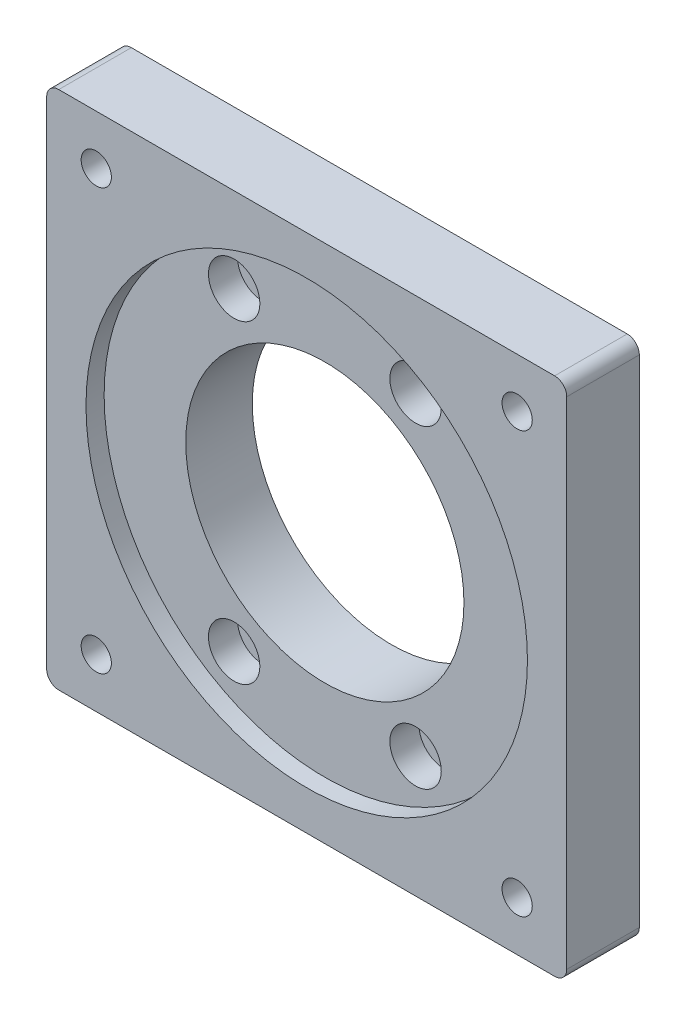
from build123d import *

# Parameters (mm, degrees)
SKETCH_1_W             = 86
SKETCH_1_H             = 86
SKETCH_1_R             = 23
EXTRUDE_1_DEPTH        = 12
SKETCH_2_R             = 2.1
CUT_EXTRUDE_1_DEPTH    = 62.983868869
SKETCH_3_R             = 36.5
CUT_EXTRUDE_2_DEPTH    = 3
SKETCH_5_R             = 2.25
CUT_EXTRUDE_3_DEPTH    = 62.473571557
SKETCH_6_R             = 4.25
CUT_EXTRUDE_4_DEPTH    = 4.8
FILLET_1_R             = 2
EXTRUDE_START          = 2
SKETCH_7_R             = 25
SKETCH_7_R_2           = 23
EXTRUDE_2_DEPTH        = 2
HOLE_WIZARD_M6_5_D     = 5
HOLE_WIZARD_M6_5_DEPTH = 15
HOLE_WIZARD_M6_5_TIP   = 1.502151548


with BuildPart() as part:
    # Sketch 1 → Extrude 1 (new body)
    with BuildSketch(Plane.XY):
        Rectangle(SKETCH_1_W, SKETCH_1_H)
        Circle(SKETCH_1_R, mode=Mode.SUBTRACT)
    extrude(amount=EXTRUDE_1_DEPTH)

    # Sketch 2 → Cut-Extrude 1 (cut, through all)
    with BuildSketch(Plane.XY.offset(12)):
        with Locations((-34.8, 34.8)):
            Circle(SKETCH_2_R)
        with Locations((34.8, 34.8)):
            Circle(SKETCH_2_R)
        with Locations((34.8, -34.8)):
            Circle(SKETCH_2_R)
        with Locations((-34.8, -34.8)):
            Circle(SKETCH_2_R)
    extrude(amount=-CUT_EXTRUDE_1_DEPTH, mode=Mode.SUBTRACT)

    # Sketch 3 → Cut-Extrude 2 (cut)
    with BuildSketch(Plane.XY.offset(12)):
        Circle(SKETCH_3_R)
    extrude(amount=-CUT_EXTRUDE_2_DEPTH, mode=Mode.SUBTRACT)

    # Sketch 5 → Cut-Extrude 3 (cut, through all)
    with BuildSketch(Plane.XY.offset(9)):
        with Locations((-15, 25.980762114)):
            Circle(SKETCH_5_R)
        with Locations((15, 25.980762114)):
            Circle(SKETCH_5_R)
        with Locations((15, -25.980762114)):
            Circle(SKETCH_5_R)
        with Locations((-15, -25.980762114)):
            Circle(SKETCH_5_R)
    extrude(amount=-CUT_EXTRUDE_3_DEPTH, mode=Mode.SUBTRACT)

    # Sketch 6 → Cut-Extrude 4 (cut)
    with BuildSketch(Plane.XY.offset(9)):
        with Locations((-15, 25.980762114)):
            Circle(SKETCH_6_R)
        with Locations((15, 25.980762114)):
            Circle(SKETCH_6_R)
        with Locations((15, -25.980762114)):
            Circle(SKETCH_6_R)
        with Locations((-15, -25.980762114)):
            Circle(SKETCH_6_R)
    extrude(amount=-CUT_EXTRUDE_4_DEPTH, mode=Mode.SUBTRACT)

    # Fillet 1
    fillet_1_edges = [part.edges().sort_by_distance(p)[0] for p in [
        (43, -43, 6),
        (-43, -43, 6),
        (-43, 43, 6),
        (43, 43, 6),
    ]]
    fillet(fillet_1_edges, radius=FILLET_1_R)

    # Sketch 7 → Extrude 2 (add)
    with BuildSketch(Plane(origin=(0, 0, 0), x_dir=(-1, 0, 0), z_dir=(0, 0, -1)).offset(EXTRUDE_START)):
        Circle(SKETCH_7_R)
        Circle(SKETCH_7_R_2, mode=Mode.SUBTRACT)
    extrude(amount=-EXTRUDE_2_DEPTH)

    # Hole Wizard M6 _5
    with Locations(Plane.XY.offset(12)):
        with Locations((-34.8, -34.8), (-34.8, 34.8), (34.8, 34.8), (34.8, -34.8)):
            Hole(HOLE_WIZARD_M6_5_D / 2, depth=HOLE_WIZARD_M6_5_DEPTH)
            with Locations((0, 0, -(HOLE_WIZARD_M6_5_DEPTH + HOLE_WIZARD_M6_5_TIP / 2))):  # 118° drill point
                Cone(0, HOLE_WIZARD_M6_5_D / 2, HOLE_WIZARD_M6_5_TIP, mode=Mode.SUBTRACT)


solid = part.part
